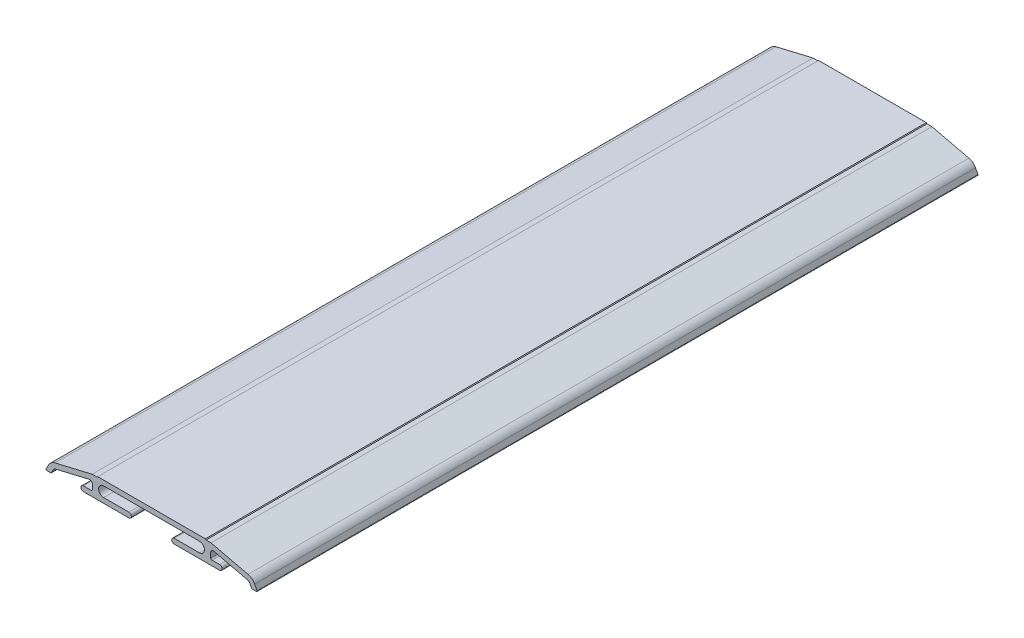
ISO-10303-21;
HEADER;
FILE_DESCRIPTION(('STEP AP214'),'2;1');
FILE_NAME('part.step','',(''),(''),'','','');
FILE_SCHEMA(('AUTOMOTIVE_DESIGN { 1 0 10303 214 1 1 1 1 }'));
ENDSEC;
DATA;
#1=APPLICATION_CONTEXT('core data for automotive mechanical design processes');
#2=APPLICATION_PROTOCOL_DEFINITION('international standard','automotive_design',2000,#1);
#3=PRODUCT_CONTEXT('',#1,'mechanical');
#4=PRODUCT('Part','Part','',(#3));
#5=PRODUCT_RELATED_PRODUCT_CATEGORY('part','',(#4));
#6=PRODUCT_DEFINITION_FORMATION('','',#4);
#7=PRODUCT_DEFINITION_CONTEXT('part definition',#1,'design');
#8=PRODUCT_DEFINITION('design','',#6,#7);
#9=PRODUCT_DEFINITION_SHAPE('','',#8);
#10=(LENGTH_UNIT() NAMED_UNIT(*) SI_UNIT(.MILLI.,.METRE.));
#11=(NAMED_UNIT(*) PLANE_ANGLE_UNIT() SI_UNIT($,.RADIAN.));
#12=(NAMED_UNIT(*) SI_UNIT($,.STERADIAN.) SOLID_ANGLE_UNIT());
#13=UNCERTAINTY_MEASURE_WITH_UNIT(LENGTH_MEASURE(1.E-05),#10,'distance_accuracy_value','');
#14=(GEOMETRIC_REPRESENTATION_CONTEXT(3) GLOBAL_UNCERTAINTY_ASSIGNED_CONTEXT((#13)) GLOBAL_UNIT_ASSIGNED_CONTEXT((#10,
#11,#12)) REPRESENTATION_CONTEXT('',''));
#15=CARTESIAN_POINT('',(0.,0.,0.));
#16=DIRECTION('',(0.,0.,1.));
#17=DIRECTION('',(1.,0.,0.));
#18=AXIS2_PLACEMENT_3D('',#15,#16,#17);
#19=CARTESIAN_POINT('',(41.0185728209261,54.1999999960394,-286.));
#20=DIRECTION('',(0.,0.,1.));
#21=DIRECTION('',(1.,0.,0.));
#22=AXIS2_PLACEMENT_3D('',#19,#20,#21);
#23=CYLINDRICAL_SURFACE('',#22,0.300000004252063);
#24=CARTESIAN_POINT('',(41.0185728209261,54.1999999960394,0.));
#25=DIRECTION('',(0.,0.,1.));
#26=DIRECTION('',(1.,0.,0.));
#27=AXIS2_PLACEMENT_3D('',#24,#25,#26);
#28=CIRCLE('',#27,0.300000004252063);
#29=CARTESIAN_POINT('',(41.0185728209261,53.8999999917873,0.));
#30=VERTEX_POINT('',#29);
#31=CARTESIAN_POINT('',(41.2840554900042,54.339710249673,0.));
#32=VERTEX_POINT('',#31);
#33=EDGE_CURVE('E342',#30,#32,#28,.T.);
#34=ORIENTED_EDGE('',*,*,#33,.F.);
#35=DIRECTION('',(0.,0.,1.));
#36=VECTOR('',#35,1.);
#37=CARTESIAN_POINT('',(41.0185728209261,53.8999999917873,-286.));
#38=LINE('',#37,#36);
#39=CARTESIAN_POINT('',(41.0185728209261,53.8999999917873,-286.));
#40=VERTEX_POINT('',#39);
#41=EDGE_CURVE('E11',#40,#30,#38,.T.);
#42=ORIENTED_EDGE('',*,*,#41,.F.);
#43=CARTESIAN_POINT('',(41.0185728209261,54.1999999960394,-286.));
#44=DIRECTION('',(0.,0.,1.));
#45=DIRECTION('',(1.,0.,0.));
#46=AXIS2_PLACEMENT_3D('',#43,#44,#45);
#47=CIRCLE('',#46,0.300000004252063);
#48=CARTESIAN_POINT('',(41.2840554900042,54.339710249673,-286.));
#49=VERTEX_POINT('',#48);
#50=EDGE_CURVE('E464',#40,#49,#47,.T.);
#51=ORIENTED_EDGE('',*,*,#50,.T.);
#52=DIRECTION('',(0.,0.,1.));
#53=VECTOR('',#52,1.);
#54=CARTESIAN_POINT('',(41.2840554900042,54.339710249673,-286.));
#55=LINE('',#54,#53);
#56=EDGE_CURVE('E44',#49,#32,#55,.T.);
#57=ORIENTED_EDGE('',*,*,#56,.T.);
#58=EDGE_LOOP('',(#34,#42,#51,#57));
#59=FACE_BOUND('',#58,.T.);
#60=ADVANCED_FACE('F41',(#59),#23,.T.);
#61=CARTESIAN_POINT('',(39.4365486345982,53.8999999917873,-286.));
#62=DIRECTION('',(0.,-1.,0.));
#63=DIRECTION('',(1.,0.,0.));
#64=AXIS2_PLACEMENT_3D('',#61,#62,#63);
#65=PLANE('',#64);
#66=DIRECTION('',(1.,0.,0.));
#67=VECTOR('',#66,1.);
#68=CARTESIAN_POINT('',(39.4365486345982,53.8999999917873,0.));
#69=LINE('',#68,#67);
#70=CARTESIAN_POINT('',(39.4365486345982,53.8999999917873,0.));
#71=VERTEX_POINT('',#70);
#72=EDGE_CURVE('E462',#71,#30,#69,.T.);
#73=ORIENTED_EDGE('',*,*,#72,.F.);
#74=DIRECTION('',(0.,0.,1.));
#75=VECTOR('',#74,1.);
#76=CARTESIAN_POINT('',(39.4365486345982,53.8999999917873,-286.));
#77=LINE('',#76,#75);
#78=CARTESIAN_POINT('',(39.4365486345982,53.8999999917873,-286.));
#79=VERTEX_POINT('',#78);
#80=EDGE_CURVE('E50',#79,#71,#77,.T.);
#81=ORIENTED_EDGE('',*,*,#80,.F.);
#82=DIRECTION('',(1.,0.,0.));
#83=VECTOR('',#82,1.);
#84=CARTESIAN_POINT('',(39.4365486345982,53.8999999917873,-286.));
#85=LINE('',#84,#83);
#86=EDGE_CURVE('E332',#79,#40,#85,.T.);
#87=ORIENTED_EDGE('',*,*,#86,.T.);
#88=ORIENTED_EDGE('',*,*,#41,.T.);
#89=EDGE_LOOP('',(#73,#81,#87,#88));
#90=FACE_BOUND('',#89,.T.);
#91=ADVANCED_FACE('F544',(#90),#65,.T.);
#92=CARTESIAN_POINT('',(39.4365486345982,54.1999999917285,-286.));
#93=DIRECTION('',(0.,0.,1.));
#94=DIRECTION('',(1.,0.,0.));
#95=AXIS2_PLACEMENT_3D('',#92,#93,#94);
#96=CYLINDRICAL_SURFACE('',#95,0.299999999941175);
#97=CARTESIAN_POINT('',(39.4365486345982,54.1999999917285,0.));
#98=DIRECTION('',(0.,0.,1.));
#99=DIRECTION('',(1.,0.,0.));
#100=AXIS2_PLACEMENT_3D('',#97,#98,#99);
#101=CIRCLE('',#100,0.299999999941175);
#102=CARTESIAN_POINT('',(39.1710659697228,54.0602897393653,0.));
#103=VERTEX_POINT('',#102);
#104=EDGE_CURVE('E319',#103,#71,#101,.T.);
#105=ORIENTED_EDGE('',*,*,#104,.F.);
#106=DIRECTION('',(0.,0.,1.));
#107=VECTOR('',#106,1.);
#108=CARTESIAN_POINT('',(39.1710659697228,54.0602897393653,-286.));
#109=LINE('',#108,#107);
#110=CARTESIAN_POINT('',(39.1710659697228,54.0602897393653,-286.));
#111=VERTEX_POINT('',#110);
#112=EDGE_CURVE('E314',#111,#103,#109,.T.);
#113=ORIENTED_EDGE('',*,*,#112,.F.);
#114=CARTESIAN_POINT('',(39.4365486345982,54.1999999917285,-286.));
#115=DIRECTION('',(0.,0.,1.));
#116=DIRECTION('',(1.,0.,0.));
#117=AXIS2_PLACEMENT_3D('',#114,#115,#116);
#118=CIRCLE('',#117,0.299999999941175);
#119=EDGE_CURVE('E317',#111,#79,#118,.T.);
#120=ORIENTED_EDGE('',*,*,#119,.T.);
#121=ORIENTED_EDGE('',*,*,#80,.T.);
#122=EDGE_LOOP('',(#105,#113,#120,#121));
#123=FACE_BOUND('',#122,.T.);
#124=ADVANCED_FACE('F316',(#123),#96,.T.);
#125=CARTESIAN_POINT('',(38.5727654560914,55.1972028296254,-286.));
#126=DIRECTION('',(-0.884942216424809,-0.465700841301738,0.));
#127=DIRECTION('',(0.465700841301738,-0.884942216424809,0.));
#128=AXIS2_PLACEMENT_3D('',#125,#126,#127);
#129=PLANE('',#128);
#130=DIRECTION('',(0.465700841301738,-0.884942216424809,0.));
#131=VECTOR('',#130,1.);
#132=CARTESIAN_POINT('',(38.5727654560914,55.1972028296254,0.));
#133=LINE('',#132,#131);
#134=CARTESIAN_POINT('',(38.5727654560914,55.1972028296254,0.));
#135=VERTEX_POINT('',#134);
#136=EDGE_CURVE('E459',#135,#103,#133,.T.);
#137=ORIENTED_EDGE('',*,*,#136,.F.);
#138=DIRECTION('',(0.,0.,1.));
#139=VECTOR('',#138,1.);
#140=CARTESIAN_POINT('',(38.5727654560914,55.1972028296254,-286.));
#141=LINE('',#140,#139);
#142=CARTESIAN_POINT('',(38.5727654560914,55.1972028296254,-286.));
#143=VERTEX_POINT('',#142);
#144=EDGE_CURVE('E324',#143,#135,#141,.T.);
#145=ORIENTED_EDGE('',*,*,#144,.F.);
#146=DIRECTION('',(0.465700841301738,-0.884942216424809,0.));
#147=VECTOR('',#146,1.);
#148=CARTESIAN_POINT('',(38.5727654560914,55.1972028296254,-286.));
#149=LINE('',#148,#147);
#150=EDGE_CURVE('E330',#143,#111,#149,.T.);
#151=ORIENTED_EDGE('',*,*,#150,.T.);
#152=ORIENTED_EDGE('',*,*,#112,.T.);
#153=EDGE_LOOP('',(#137,#145,#151,#152));
#154=FACE_BOUND('',#153,.T.);
#155=ADVANCED_FACE('F334',(#154),#129,.T.);
#156=CARTESIAN_POINT('',(36.8028810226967,54.2658011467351,-286.));
#157=DIRECTION('',(0.,0.,1.));
#158=DIRECTION('',(1.,0.,0.));
#159=AXIS2_PLACEMENT_3D('',#156,#157,#158);
#160=CYLINDRICAL_SURFACE('',#159,2.00000000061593);
#161=CARTESIAN_POINT('',(36.8028810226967,54.2658011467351,0.));
#162=DIRECTION('',(0.,0.,-1.));
#163=DIRECTION('',(-1.,0.,0.));
#164=AXIS2_PLACEMENT_3D('',#161,#162,#163);
#165=CIRCLE('',#164,2.00000000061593);
#166=CARTESIAN_POINT('',(37.2627042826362,56.2122241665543,0.));
#167=VERTEX_POINT('',#166);
#168=EDGE_CURVE('E456',#167,#135,#165,.T.);
#169=ORIENTED_EDGE('',*,*,#168,.F.);
#170=DIRECTION('',(0.,0.,1.));
#171=VECTOR('',#170,1.);
#172=CARTESIAN_POINT('',(37.2627042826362,56.2122241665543,-286.));
#173=LINE('',#172,#171);
#174=CARTESIAN_POINT('',(37.2627042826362,56.2122241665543,-286.));
#175=VERTEX_POINT('',#174);
#176=EDGE_CURVE('E468',#175,#167,#173,.T.);
#177=ORIENTED_EDGE('',*,*,#176,.F.);
#178=CARTESIAN_POINT('',(36.8028810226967,54.2658011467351,-286.));
#179=DIRECTION('',(0.,0.,-1.));
#180=DIRECTION('',(-1.,0.,0.));
#181=AXIS2_PLACEMENT_3D('',#178,#179,#180);
#182=CIRCLE('',#181,2.00000000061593);
#183=EDGE_CURVE('E335',#175,#143,#182,.T.);
#184=ORIENTED_EDGE('',*,*,#183,.T.);
#185=ORIENTED_EDGE('',*,*,#144,.T.);
#186=EDGE_LOOP('',(#169,#177,#184,#185));
#187=FACE_BOUND('',#186,.T.);
#188=ADVANCED_FACE('F557',(#187),#160,.F.);
#189=CARTESIAN_POINT('',(24.1453646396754,59.3110664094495,-286.));
#190=DIRECTION('',(-0.229911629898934,-0.973211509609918,0.));
#191=DIRECTION('',(0.973211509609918,-0.229911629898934,0.));
#192=AXIS2_PLACEMENT_3D('',#189,#190,#191);
#193=PLANE('',#192);
#194=DIRECTION('',(0.973211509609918,-0.229911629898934,0.));
#195=VECTOR('',#194,1.);
#196=CARTESIAN_POINT('',(24.1453646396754,59.3110664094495,0.));
#197=LINE('',#196,#195);
#198=CARTESIAN_POINT('',(24.1453646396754,59.3110664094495,0.));
#199=VERTEX_POINT('',#198);
#200=EDGE_CURVE('E453',#199,#167,#197,.T.);
#201=ORIENTED_EDGE('',*,*,#200,.F.);
#202=DIRECTION('',(0.,0.,1.));
#203=VECTOR('',#202,1.);
#204=CARTESIAN_POINT('',(24.1453646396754,59.3110664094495,-286.));
#205=LINE('',#204,#203);
#206=CARTESIAN_POINT('',(24.1453646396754,59.3110664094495,-286.));
#207=VERTEX_POINT('',#206);
#208=EDGE_CURVE('E470',#207,#199,#205,.T.);
#209=ORIENTED_EDGE('',*,*,#208,.F.);
#210=DIRECTION('',(0.973211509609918,-0.229911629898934,0.));
#211=VECTOR('',#210,1.);
#212=CARTESIAN_POINT('',(24.1453646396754,59.3110664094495,-286.));
#213=LINE('',#212,#211);
#214=EDGE_CURVE('E337',#207,#175,#213,.T.);
#215=ORIENTED_EDGE('',*,*,#214,.T.);
#216=ORIENTED_EDGE('',*,*,#176,.T.);
#217=EDGE_LOOP('',(#201,#209,#215,#216));
#218=FACE_BOUND('',#217,.T.);
#219=ADVANCED_FACE('F560',(#218),#193,.T.);
#220=CARTESIAN_POINT('',(23.9154530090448,58.3378548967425,-286.));
#221=DIRECTION('',(0.,0.,1.));
#222=DIRECTION('',(1.,0.,0.));
#223=AXIS2_PLACEMENT_3D('',#220,#221,#222);
#224=CYLINDRICAL_SURFACE('',#223,1.00000000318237);
#225=CARTESIAN_POINT('',(23.9154530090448,58.3378548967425,0.));
#226=DIRECTION('',(0.,0.,-1.));
#227=DIRECTION('',(-1.,0.,0.));
#228=AXIS2_PLACEMENT_3D('',#225,#226,#227);
#229=CIRCLE('',#228,1.00000000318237);
#230=CARTESIAN_POINT('',(22.9154530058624,58.3378548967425,0.));
#231=VERTEX_POINT('',#230);
#232=EDGE_CURVE('E450',#231,#199,#229,.T.);
#233=ORIENTED_EDGE('',*,*,#232,.F.);
#234=DIRECTION('',(0.,0.,1.));
#235=VECTOR('',#234,1.);
#236=CARTESIAN_POINT('',(22.9154530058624,58.3378548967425,-286.));
#237=LINE('',#236,#235);
#238=CARTESIAN_POINT('',(22.9154530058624,58.3378548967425,-286.));
#239=VERTEX_POINT('',#238);
#240=EDGE_CURVE('E472',#239,#231,#237,.T.);
#241=ORIENTED_EDGE('',*,*,#240,.F.);
#242=CARTESIAN_POINT('',(23.9154530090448,58.3378548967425,-286.));
#243=DIRECTION('',(0.,0.,-1.));
#244=DIRECTION('',(-1.,0.,0.));
#245=AXIS2_PLACEMENT_3D('',#242,#243,#244);
#246=CIRCLE('',#245,1.00000000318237);
#247=EDGE_CURVE('E1146',#239,#207,#246,.T.);
#248=ORIENTED_EDGE('',*,*,#247,.T.);
#249=ORIENTED_EDGE('',*,*,#208,.T.);
#250=EDGE_LOOP('',(#233,#241,#248,#249));
#251=FACE_BOUND('',#250,.T.);
#252=ADVANCED_FACE('F564',(#251),#224,.F.);
#253=CARTESIAN_POINT('',(22.9154530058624,56.3999999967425,-286.));
#254=DIRECTION('',(1.,0.,0.));
#255=DIRECTION('',(0.,1.,0.));
#256=AXIS2_PLACEMENT_3D('',#253,#254,#255);
#257=PLANE('',#256);
#258=DIRECTION('',(0.,1.,0.));
#259=VECTOR('',#258,1.);
#260=CARTESIAN_POINT('',(22.9154530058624,56.3999999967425,0.));
#261=LINE('',#260,#259);
#262=CARTESIAN_POINT('',(22.9154530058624,56.3999999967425,0.));
#263=VERTEX_POINT('',#262);
#264=EDGE_CURVE('E447',#263,#231,#261,.T.);
#265=ORIENTED_EDGE('',*,*,#264,.F.);
#266=DIRECTION('',(0.,0.,1.));
#267=VECTOR('',#266,1.);
#268=CARTESIAN_POINT('',(22.9154530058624,56.3999999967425,-286.));
#269=LINE('',#268,#267);
#270=CARTESIAN_POINT('',(22.9154530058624,56.3999999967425,-286.));
#271=VERTEX_POINT('',#270);
#272=EDGE_CURVE('E474',#271,#263,#269,.T.);
#273=ORIENTED_EDGE('',*,*,#272,.F.);
#274=DIRECTION('',(0.,1.,0.));
#275=VECTOR('',#274,1.);
#276=CARTESIAN_POINT('',(22.9154530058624,56.3999999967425,-286.));
#277=LINE('',#276,#275);
#278=EDGE_CURVE('E1150',#271,#239,#277,.T.);
#279=ORIENTED_EDGE('',*,*,#278,.T.);
#280=ORIENTED_EDGE('',*,*,#240,.T.);
#281=EDGE_LOOP('',(#265,#273,#279,#280));
#282=FACE_BOUND('',#281,.T.);
#283=ADVANCED_FACE('F568',(#282),#257,.T.);
#284=CARTESIAN_POINT('',(23.4154530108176,56.3999999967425,-286.));
#285=DIRECTION('',(0.,0.,1.));
#286=DIRECTION('',(1.,0.,0.));
#287=AXIS2_PLACEMENT_3D('',#284,#285,#286);
#288=CYLINDRICAL_SURFACE('',#287,0.500000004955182);
#289=CARTESIAN_POINT('',(23.4154530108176,56.3999999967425,0.));
#290=DIRECTION('',(0.,0.,-1.));
#291=DIRECTION('',(-1.,0.,0.));
#292=AXIS2_PLACEMENT_3D('',#289,#290,#291);
#293=CIRCLE('',#292,0.500000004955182);
#294=CARTESIAN_POINT('',(23.4154530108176,55.8999999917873,0.));
#295=VERTEX_POINT('',#294);
#296=EDGE_CURVE('E444',#295,#263,#293,.T.);
#297=ORIENTED_EDGE('',*,*,#296,.F.);
#298=DIRECTION('',(0.,0.,1.));
#299=VECTOR('',#298,1.);
#300=CARTESIAN_POINT('',(23.4154530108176,55.8999999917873,-286.));
#301=LINE('',#300,#299);
#302=CARTESIAN_POINT('',(23.4154530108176,55.8999999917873,-286.));
#303=VERTEX_POINT('',#302);
#304=EDGE_CURVE('E476',#303,#295,#301,.T.);
#305=ORIENTED_EDGE('',*,*,#304,.F.);
#306=CARTESIAN_POINT('',(23.4154530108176,56.3999999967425,-286.));
#307=DIRECTION('',(0.,0.,-1.));
#308=DIRECTION('',(-1.,0.,0.));
#309=AXIS2_PLACEMENT_3D('',#306,#307,#308);
#310=CIRCLE('',#309,0.500000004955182);
#311=EDGE_CURVE('E1139',#303,#271,#310,.T.);
#312=ORIENTED_EDGE('',*,*,#311,.T.);
#313=ORIENTED_EDGE('',*,*,#272,.T.);
#314=EDGE_LOOP('',(#297,#305,#312,#313));
#315=FACE_BOUND('',#314,.T.);
#316=ADVANCED_FACE('F572',(#315),#288,.F.);
#317=CARTESIAN_POINT('',(26.4454530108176,55.8999999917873,-286.));
#318=DIRECTION('',(0.,1.,0.));
#319=DIRECTION('',(0.,0.,1.));
#320=AXIS2_PLACEMENT_3D('',#317,#318,#319);
#321=PLANE('',#320);
#322=DIRECTION('',(-1.,0.,0.));
#323=VECTOR('',#322,1.);
#324=CARTESIAN_POINT('',(26.4454530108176,55.8999999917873,0.));
#325=LINE('',#324,#323);
#326=CARTESIAN_POINT('',(26.4454530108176,55.8999999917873,0.));
#327=VERTEX_POINT('',#326);
#328=EDGE_CURVE('E441',#327,#295,#325,.T.);
#329=ORIENTED_EDGE('',*,*,#328,.F.);
#330=DIRECTION('',(0.,0.,1.));
#331=VECTOR('',#330,1.);
#332=CARTESIAN_POINT('',(26.4454530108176,55.8999999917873,-286.));
#333=LINE('',#332,#331);
#334=CARTESIAN_POINT('',(26.4454530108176,55.8999999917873,-286.));
#335=VERTEX_POINT('',#334);
#336=EDGE_CURVE('E478',#335,#327,#333,.T.);
#337=ORIENTED_EDGE('',*,*,#336,.F.);
#338=DIRECTION('',(-1.,0.,0.));
#339=VECTOR('',#338,1.);
#340=CARTESIAN_POINT('',(26.4454530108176,55.8999999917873,-286.));
#341=LINE('',#340,#339);
#342=EDGE_CURVE('E1135',#335,#303,#341,.T.);
#343=ORIENTED_EDGE('',*,*,#342,.T.);
#344=ORIENTED_EDGE('',*,*,#304,.T.);
#345=EDGE_LOOP('',(#329,#337,#343,#344));
#346=FACE_BOUND('',#345,.T.);
#347=ADVANCED_FACE('F576',(#346),#321,.T.);
#348=CARTESIAN_POINT('',(26.4454530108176,54.8999999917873,-286.));
#349=DIRECTION('',(0.,0.,1.));
#350=DIRECTION('',(1.,0.,0.));
#351=AXIS2_PLACEMENT_3D('',#348,#349,#350);
#352=CYLINDRICAL_SURFACE('',#351,1.);
#353=CARTESIAN_POINT('',(26.4454530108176,54.8999999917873,0.));
#354=DIRECTION('',(0.,0.,1.));
#355=DIRECTION('',(1.,0.,0.));
#356=AXIS2_PLACEMENT_3D('',#353,#354,#355);
#357=CIRCLE('',#356,1.);
#358=CARTESIAN_POINT('',(26.4454530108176,53.8999999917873,0.));
#359=VERTEX_POINT('',#358);
#360=EDGE_CURVE('E438',#359,#327,#357,.T.);
#361=ORIENTED_EDGE('',*,*,#360,.F.);
#362=DIRECTION('',(0.,0.,1.));
#363=VECTOR('',#362,1.);
#364=CARTESIAN_POINT('',(26.4454530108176,53.8999999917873,-286.));
#365=LINE('',#364,#363);
#366=CARTESIAN_POINT('',(26.4454530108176,53.8999999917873,-286.));
#367=VERTEX_POINT('',#366);
#368=EDGE_CURVE('E480',#367,#359,#365,.T.);
#369=ORIENTED_EDGE('',*,*,#368,.F.);
#370=CARTESIAN_POINT('',(26.4454530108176,54.8999999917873,-286.));
#371=DIRECTION('',(0.,0.,1.));
#372=DIRECTION('',(1.,0.,0.));
#373=AXIS2_PLACEMENT_3D('',#370,#371,#372);
#374=CIRCLE('',#373,1.);
#375=EDGE_CURVE('E1156',#367,#335,#374,.T.);
#376=ORIENTED_EDGE('',*,*,#375,.T.);
#377=ORIENTED_EDGE('',*,*,#336,.T.);
#378=EDGE_LOOP('',(#361,#369,#376,#377));
#379=FACE_BOUND('',#378,.T.);
#380=ADVANCED_FACE('F580',(#379),#352,.T.);
#381=CARTESIAN_POINT('',(8.44545301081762,53.8999999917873,-286.));
#382=DIRECTION('',(0.,-1.,0.));
#383=DIRECTION('',(0.,0.,-1.));
#384=AXIS2_PLACEMENT_3D('',#381,#382,#383);
#385=PLANE('',#384);
#386=DIRECTION('',(1.,0.,0.));
#387=VECTOR('',#386,1.);
#388=CARTESIAN_POINT('',(8.44545301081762,53.8999999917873,0.));
#389=LINE('',#388,#387);
#390=CARTESIAN_POINT('',(8.44545301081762,53.8999999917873,0.));
#391=VERTEX_POINT('',#390);
#392=EDGE_CURVE('E435',#391,#359,#389,.T.);
#393=ORIENTED_EDGE('',*,*,#392,.F.);
#394=DIRECTION('',(0.,0.,1.));
#395=VECTOR('',#394,1.);
#396=CARTESIAN_POINT('',(8.44545301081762,53.8999999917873,-286.));
#397=LINE('',#396,#395);
#398=CARTESIAN_POINT('',(8.44545301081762,53.8999999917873,-286.));
#399=VERTEX_POINT('',#398);
#400=EDGE_CURVE('E482',#399,#391,#397,.T.);
#401=ORIENTED_EDGE('',*,*,#400,.F.);
#402=DIRECTION('',(1.,0.,0.));
#403=VECTOR('',#402,1.);
#404=CARTESIAN_POINT('',(8.44545301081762,53.8999999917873,-286.));
#405=LINE('',#404,#403);
#406=EDGE_CURVE('E1128',#399,#367,#405,.T.);
#407=ORIENTED_EDGE('',*,*,#406,.T.);
#408=ORIENTED_EDGE('',*,*,#368,.T.);
#409=EDGE_LOOP('',(#393,#401,#407,#408));
#410=FACE_BOUND('',#409,.T.);
#411=ADVANCED_FACE('F584',(#410),#385,.T.);
#412=CARTESIAN_POINT('',(8.44545301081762,54.8999999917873,-286.));
#413=DIRECTION('',(0.,0.,1.));
#414=DIRECTION('',(1.,0.,0.));
#415=AXIS2_PLACEMENT_3D('',#412,#413,#414);
#416=CYLINDRICAL_SURFACE('',#415,1.);
#417=CARTESIAN_POINT('',(8.44545301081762,54.8999999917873,0.));
#418=DIRECTION('',(0.,0.,1.));
#419=DIRECTION('',(1.,0.,0.));
#420=AXIS2_PLACEMENT_3D('',#417,#418,#419);
#421=CIRCLE('',#420,1.);
#422=CARTESIAN_POINT('',(8.44545301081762,55.8999999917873,0.));
#423=VERTEX_POINT('',#422);
#424=EDGE_CURVE('E432',#423,#391,#421,.T.);
#425=ORIENTED_EDGE('',*,*,#424,.F.);
#426=DIRECTION('',(0.,0.,1.));
#427=VECTOR('',#426,1.);
#428=CARTESIAN_POINT('',(8.44545301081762,55.8999999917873,-286.));
#429=LINE('',#428,#427);
#430=CARTESIAN_POINT('',(8.44545301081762,55.8999999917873,-286.));
#431=VERTEX_POINT('',#430);
#432=EDGE_CURVE('E484',#431,#423,#429,.T.);
#433=ORIENTED_EDGE('',*,*,#432,.F.);
#434=CARTESIAN_POINT('',(8.44545301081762,54.8999999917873,-286.));
#435=DIRECTION('',(0.,0.,1.));
#436=DIRECTION('',(1.,0.,0.));
#437=AXIS2_PLACEMENT_3D('',#434,#435,#436);
#438=CIRCLE('',#437,1.);
#439=EDGE_CURVE('E1124',#431,#399,#438,.T.);
#440=ORIENTED_EDGE('',*,*,#439,.T.);
#441=ORIENTED_EDGE('',*,*,#400,.T.);
#442=EDGE_LOOP('',(#425,#433,#440,#441));
#443=FACE_BOUND('',#442,.T.);
#444=ADVANCED_FACE('F588',(#443),#416,.T.);
#445=CARTESIAN_POINT('',(18.4454530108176,55.8999999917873,-286.));
#446=DIRECTION('',(0.,1.,0.));
#447=DIRECTION('',(-1.,0.,0.));
#448=AXIS2_PLACEMENT_3D('',#445,#446,#447);
#449=PLANE('',#448);
#450=DIRECTION('',(-1.,0.,0.));
#451=VECTOR('',#450,1.);
#452=CARTESIAN_POINT('',(18.4454530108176,55.8999999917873,0.));
#453=LINE('',#452,#451);
#454=CARTESIAN_POINT('',(18.4454530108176,55.8999999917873,0.));
#455=VERTEX_POINT('',#454);
#456=EDGE_CURVE('E429',#455,#423,#453,.T.);
#457=ORIENTED_EDGE('',*,*,#456,.F.);
#458=DIRECTION('',(0.,0.,1.));
#459=VECTOR('',#458,1.);
#460=CARTESIAN_POINT('',(18.4454530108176,55.8999999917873,-286.));
#461=LINE('',#460,#459);
#462=CARTESIAN_POINT('',(18.4454530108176,55.8999999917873,-286.));
#463=VERTEX_POINT('',#462);
#464=EDGE_CURVE('E486',#463,#455,#461,.T.);
#465=ORIENTED_EDGE('',*,*,#464,.F.);
#466=DIRECTION('',(-1.,0.,0.));
#467=VECTOR('',#466,1.);
#468=CARTESIAN_POINT('',(18.4454530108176,55.8999999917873,-286.));
#469=LINE('',#468,#467);
#470=EDGE_CURVE('E1160',#463,#431,#469,.T.);
#471=ORIENTED_EDGE('',*,*,#470,.T.);
#472=ORIENTED_EDGE('',*,*,#432,.T.);
#473=EDGE_LOOP('',(#457,#465,#471,#472));
#474=FACE_BOUND('',#473,.T.);
#475=ADVANCED_FACE('F592',(#474),#449,.T.);
#476=CARTESIAN_POINT('',(18.4454530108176,57.8999999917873,-286.));
#477=DIRECTION('',(0.,0.,1.));
#478=DIRECTION('',(1.,0.,0.));
#479=AXIS2_PLACEMENT_3D('',#476,#477,#478);
#480=CYLINDRICAL_SURFACE('',#479,2.);
#481=CARTESIAN_POINT('',(18.4454530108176,57.8999999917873,0.));
#482=DIRECTION('',(0.,0.,-1.));
#483=DIRECTION('',(-1.,0.,0.));
#484=AXIS2_PLACEMENT_3D('',#481,#482,#483);
#485=CIRCLE('',#484,2.);
#486=CARTESIAN_POINT('',(18.4454530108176,59.8999999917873,0.));
#487=VERTEX_POINT('',#486);
#488=EDGE_CURVE('E426',#487,#455,#485,.T.);
#489=ORIENTED_EDGE('',*,*,#488,.F.);
#490=DIRECTION('',(0.,0.,1.));
#491=VECTOR('',#490,1.);
#492=CARTESIAN_POINT('',(18.4454530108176,59.8999999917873,-286.));
#493=LINE('',#492,#491);
#494=CARTESIAN_POINT('',(18.4454530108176,59.8999999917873,-286.));
#495=VERTEX_POINT('',#494);
#496=EDGE_CURVE('E488',#495,#487,#493,.T.);
#497=ORIENTED_EDGE('',*,*,#496,.F.);
#498=CARTESIAN_POINT('',(18.4454530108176,57.8999999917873,-286.));
#499=DIRECTION('',(0.,0.,-1.));
#500=DIRECTION('',(-1.,0.,0.));
#501=AXIS2_PLACEMENT_3D('',#498,#499,#500);
#502=CIRCLE('',#501,2.);
#503=EDGE_CURVE('E1117',#495,#463,#502,.T.);
#504=ORIENTED_EDGE('',*,*,#503,.T.);
#505=ORIENTED_EDGE('',*,*,#464,.T.);
#506=EDGE_LOOP('',(#489,#497,#504,#505));
#507=FACE_BOUND('',#506,.T.);
#508=ADVANCED_FACE('F596',(#507),#480,.F.);
#509=CARTESIAN_POINT('',(-19.5545469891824,59.8999999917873,-286.));
#510=DIRECTION('',(0.,-1.,0.));
#511=DIRECTION('',(0.,0.,-1.));
#512=AXIS2_PLACEMENT_3D('',#509,#510,#511);
#513=PLANE('',#512);
#514=DIRECTION('',(1.,0.,0.));
#515=VECTOR('',#514,1.);
#516=CARTESIAN_POINT('',(-19.5545469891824,59.8999999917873,0.));
#517=LINE('',#516,#515);
#518=CARTESIAN_POINT('',(-19.5545469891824,59.8999999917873,0.));
#519=VERTEX_POINT('',#518);
#520=EDGE_CURVE('E423',#519,#487,#517,.T.);
#521=ORIENTED_EDGE('',*,*,#520,.F.);
#522=DIRECTION('',(0.,0.,1.));
#523=VECTOR('',#522,1.);
#524=CARTESIAN_POINT('',(-19.5545469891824,59.8999999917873,-286.));
#525=LINE('',#524,#523);
#526=CARTESIAN_POINT('',(-19.5545469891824,59.8999999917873,-286.));
#527=VERTEX_POINT('',#526);
#528=EDGE_CURVE('E490',#527,#519,#525,.T.);
#529=ORIENTED_EDGE('',*,*,#528,.F.);
#530=DIRECTION('',(1.,0.,0.));
#531=VECTOR('',#530,1.);
#532=CARTESIAN_POINT('',(-19.5545469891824,59.8999999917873,-286.));
#533=LINE('',#532,#531);
#534=EDGE_CURVE('E1113',#527,#495,#533,.T.);
#535=ORIENTED_EDGE('',*,*,#534,.T.);
#536=ORIENTED_EDGE('',*,*,#496,.T.);
#537=EDGE_LOOP('',(#521,#529,#535,#536));
#538=FACE_BOUND('',#537,.T.);
#539=ADVANCED_FACE('F600',(#538),#513,.T.);
#540=CARTESIAN_POINT('',(-19.5545469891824,57.8999999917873,-286.));
#541=DIRECTION('',(0.,0.,1.));
#542=DIRECTION('',(1.,0.,0.));
#543=AXIS2_PLACEMENT_3D('',#540,#541,#542);
#544=CYLINDRICAL_SURFACE('',#543,2.);
#545=CARTESIAN_POINT('',(-19.5545469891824,57.8999999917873,0.));
#546=DIRECTION('',(0.,0.,-1.));
#547=DIRECTION('',(-1.,0.,0.));
#548=AXIS2_PLACEMENT_3D('',#545,#546,#547);
#549=CIRCLE('',#548,2.);
#550=CARTESIAN_POINT('',(-19.5545469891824,55.8999999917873,0.));
#551=VERTEX_POINT('',#550);
#552=EDGE_CURVE('E420',#551,#519,#549,.T.);
#553=ORIENTED_EDGE('',*,*,#552,.F.);
#554=DIRECTION('',(0.,0.,1.));
#555=VECTOR('',#554,1.);
#556=CARTESIAN_POINT('',(-19.5545469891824,55.8999999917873,-286.));
#557=LINE('',#556,#555);
#558=CARTESIAN_POINT('',(-19.5545469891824,55.8999999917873,-286.));
#559=VERTEX_POINT('',#558);
#560=EDGE_CURVE('E492',#559,#551,#557,.T.);
#561=ORIENTED_EDGE('',*,*,#560,.F.);
#562=CARTESIAN_POINT('',(-19.5545469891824,57.8999999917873,-286.));
#563=DIRECTION('',(0.,0.,-1.));
#564=DIRECTION('',(-1.,0.,0.));
#565=AXIS2_PLACEMENT_3D('',#562,#563,#564);
#566=CIRCLE('',#565,2.);
#567=EDGE_CURVE('E1164',#559,#527,#566,.T.);
#568=ORIENTED_EDGE('',*,*,#567,.T.);
#569=ORIENTED_EDGE('',*,*,#528,.T.);
#570=EDGE_LOOP('',(#553,#561,#568,#569));
#571=FACE_BOUND('',#570,.T.);
#572=ADVANCED_FACE('F604',(#571),#544,.F.);
#573=CARTESIAN_POINT('',(-9.55454698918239,55.8999999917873,-286.));
#574=DIRECTION('',(0.,1.,0.));
#575=DIRECTION('',(0.,0.,1.));
#576=AXIS2_PLACEMENT_3D('',#573,#574,#575);
#577=PLANE('',#576);
#578=DIRECTION('',(-1.,0.,0.));
#579=VECTOR('',#578,1.);
#580=CARTESIAN_POINT('',(-9.55454698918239,55.8999999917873,0.));
#581=LINE('',#580,#579);
#582=CARTESIAN_POINT('',(-9.55454698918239,55.8999999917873,0.));
#583=VERTEX_POINT('',#582);
#584=EDGE_CURVE('E417',#583,#551,#581,.T.);
#585=ORIENTED_EDGE('',*,*,#584,.F.);
#586=DIRECTION('',(0.,0.,1.));
#587=VECTOR('',#586,1.);
#588=CARTESIAN_POINT('',(-9.55454698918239,55.8999999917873,-286.));
#589=LINE('',#588,#587);
#590=CARTESIAN_POINT('',(-9.55454698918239,55.8999999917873,-286.));
#591=VERTEX_POINT('',#590);
#592=EDGE_CURVE('E494',#591,#583,#589,.T.);
#593=ORIENTED_EDGE('',*,*,#592,.F.);
#594=DIRECTION('',(-1.,0.,0.));
#595=VECTOR('',#594,1.);
#596=CARTESIAN_POINT('',(-9.55454698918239,55.8999999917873,-286.));
#597=LINE('',#596,#595);
#598=EDGE_CURVE('E1106',#591,#559,#597,.T.);
#599=ORIENTED_EDGE('',*,*,#598,.T.);
#600=ORIENTED_EDGE('',*,*,#560,.T.);
#601=EDGE_LOOP('',(#585,#593,#599,#600));
#602=FACE_BOUND('',#601,.T.);
#603=ADVANCED_FACE('F608',(#602),#577,.T.);
#604=CARTESIAN_POINT('',(-9.55454698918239,54.8999999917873,-286.));
#605=DIRECTION('',(0.,0.,1.));
#606=DIRECTION('',(1.,0.,0.));
#607=AXIS2_PLACEMENT_3D('',#604,#605,#606);
#608=CYLINDRICAL_SURFACE('',#607,1.);
#609=CARTESIAN_POINT('',(-9.55454698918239,54.8999999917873,0.));
#610=DIRECTION('',(0.,0.,1.));
#611=DIRECTION('',(1.,0.,0.));
#612=AXIS2_PLACEMENT_3D('',#609,#610,#611);
#613=CIRCLE('',#612,1.);
#614=CARTESIAN_POINT('',(-9.55454698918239,53.8999999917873,0.));
#615=VERTEX_POINT('',#614);
#616=EDGE_CURVE('E414',#615,#583,#613,.T.);
#617=ORIENTED_EDGE('',*,*,#616,.F.);
#618=DIRECTION('',(0.,0.,1.));
#619=VECTOR('',#618,1.);
#620=CARTESIAN_POINT('',(-9.55454698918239,53.8999999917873,-286.));
#621=LINE('',#620,#619);
#622=CARTESIAN_POINT('',(-9.55454698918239,53.8999999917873,-286.));
#623=VERTEX_POINT('',#622);
#624=EDGE_CURVE('E496',#623,#615,#621,.T.);
#625=ORIENTED_EDGE('',*,*,#624,.F.);
#626=CARTESIAN_POINT('',(-9.55454698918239,54.8999999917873,-286.));
#627=DIRECTION('',(0.,0.,1.));
#628=DIRECTION('',(1.,0.,0.));
#629=AXIS2_PLACEMENT_3D('',#626,#627,#628);
#630=CIRCLE('',#629,1.);
#631=EDGE_CURVE('E1102',#623,#591,#630,.T.);
#632=ORIENTED_EDGE('',*,*,#631,.T.);
#633=ORIENTED_EDGE('',*,*,#592,.T.);
#634=EDGE_LOOP('',(#617,#625,#632,#633));
#635=FACE_BOUND('',#634,.T.);
#636=ADVANCED_FACE('F612',(#635),#608,.T.);
#637=CARTESIAN_POINT('',(-27.5545469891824,53.8999999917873,-286.));
#638=DIRECTION('',(0.,-1.,0.));
#639=DIRECTION('',(1.,0.,0.));
#640=AXIS2_PLACEMENT_3D('',#637,#638,#639);
#641=PLANE('',#640);
#642=DIRECTION('',(1.,0.,0.));
#643=VECTOR('',#642,1.);
#644=CARTESIAN_POINT('',(-27.5545469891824,53.8999999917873,0.));
#645=LINE('',#644,#643);
#646=CARTESIAN_POINT('',(-27.5545469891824,53.8999999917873,0.));
#647=VERTEX_POINT('',#646);
#648=EDGE_CURVE('E411',#647,#615,#645,.T.);
#649=ORIENTED_EDGE('',*,*,#648,.F.);
#650=DIRECTION('',(0.,0.,1.));
#651=VECTOR('',#650,1.);
#652=CARTESIAN_POINT('',(-27.5545469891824,53.8999999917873,-286.));
#653=LINE('',#652,#651);
#654=CARTESIAN_POINT('',(-27.5545469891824,53.8999999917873,-286.));
#655=VERTEX_POINT('',#654);
#656=EDGE_CURVE('E498',#655,#647,#653,.T.);
#657=ORIENTED_EDGE('',*,*,#656,.F.);
#658=DIRECTION('',(1.,0.,0.));
#659=VECTOR('',#658,1.);
#660=CARTESIAN_POINT('',(-27.5545469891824,53.8999999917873,-286.));
#661=LINE('',#660,#659);
#662=EDGE_CURVE('E1168',#655,#623,#661,.T.);
#663=ORIENTED_EDGE('',*,*,#662,.T.);
#664=ORIENTED_EDGE('',*,*,#624,.T.);
#665=EDGE_LOOP('',(#649,#657,#663,#664));
#666=FACE_BOUND('',#665,.T.);
#667=ADVANCED_FACE('F616',(#666),#641,.T.);
#668=CARTESIAN_POINT('',(-27.5545469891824,54.8999999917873,-286.));
#669=DIRECTION('',(0.,0.,1.));
#670=DIRECTION('',(1.,0.,0.));
#671=AXIS2_PLACEMENT_3D('',#668,#669,#670);
#672=CYLINDRICAL_SURFACE('',#671,0.999999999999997);
#673=CARTESIAN_POINT('',(-27.5545469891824,54.8999999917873,0.));
#674=DIRECTION('',(0.,0.,1.));
#675=DIRECTION('',(1.,0.,0.));
#676=AXIS2_PLACEMENT_3D('',#673,#674,#675);
#677=CIRCLE('',#676,0.999999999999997);
#678=CARTESIAN_POINT('',(-27.5545469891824,55.8999999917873,0.));
#679=VERTEX_POINT('',#678);
#680=EDGE_CURVE('E408',#679,#647,#677,.T.);
#681=ORIENTED_EDGE('',*,*,#680,.F.);
#682=DIRECTION('',(0.,0.,1.));
#683=VECTOR('',#682,1.);
#684=CARTESIAN_POINT('',(-27.5545469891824,55.8999999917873,-286.));
#685=LINE('',#684,#683);
#686=CARTESIAN_POINT('',(-27.5545469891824,55.8999999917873,-286.));
#687=VERTEX_POINT('',#686);
#688=EDGE_CURVE('E500',#687,#679,#685,.T.);
#689=ORIENTED_EDGE('',*,*,#688,.F.);
#690=CARTESIAN_POINT('',(-27.5545469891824,54.8999999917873,-286.));
#691=DIRECTION('',(0.,0.,1.));
#692=DIRECTION('',(1.,0.,0.));
#693=AXIS2_PLACEMENT_3D('',#690,#691,#692);
#694=CIRCLE('',#693,0.999999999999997);
#695=EDGE_CURVE('E1095',#687,#655,#694,.T.);
#696=ORIENTED_EDGE('',*,*,#695,.T.);
#697=ORIENTED_EDGE('',*,*,#656,.T.);
#698=EDGE_LOOP('',(#681,#689,#696,#697));
#699=FACE_BOUND('',#698,.T.);
#700=ADVANCED_FACE('F620',(#699),#672,.T.);
#701=CARTESIAN_POINT('',(-24.5245469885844,55.8999999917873,-286.));
#702=DIRECTION('',(0.,1.,0.));
#703=DIRECTION('',(-1.,0.,0.));
#704=AXIS2_PLACEMENT_3D('',#701,#702,#703);
#705=PLANE('',#704);
#706=DIRECTION('',(-1.,0.,0.));
#707=VECTOR('',#706,1.);
#708=CARTESIAN_POINT('',(-24.5245469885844,55.8999999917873,0.));
#709=LINE('',#708,#707);
#710=CARTESIAN_POINT('',(-24.5245469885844,55.8999999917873,0.));
#711=VERTEX_POINT('',#710);
#712=EDGE_CURVE('E405',#711,#679,#709,.T.);
#713=ORIENTED_EDGE('',*,*,#712,.F.);
#714=DIRECTION('',(0.,0.,1.));
#715=VECTOR('',#714,1.);
#716=CARTESIAN_POINT('',(-24.5245469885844,55.8999999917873,-286.));
#717=LINE('',#716,#715);
#718=CARTESIAN_POINT('',(-24.5245469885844,55.8999999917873,-286.));
#719=VERTEX_POINT('',#718);
#720=EDGE_CURVE('E502',#719,#711,#717,.T.);
#721=ORIENTED_EDGE('',*,*,#720,.F.);
#722=DIRECTION('',(-1.,0.,0.));
#723=VECTOR('',#722,1.);
#724=CARTESIAN_POINT('',(-24.5245469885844,55.8999999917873,-286.));
#725=LINE('',#724,#723);
#726=EDGE_CURVE('E1091',#719,#687,#725,.T.);
#727=ORIENTED_EDGE('',*,*,#726,.T.);
#728=ORIENTED_EDGE('',*,*,#688,.T.);
#729=EDGE_LOOP('',(#713,#721,#727,#728));
#730=FACE_BOUND('',#729,.T.);
#731=ADVANCED_FACE('F624',(#730),#705,.T.);
#732=CARTESIAN_POINT('',(-24.5245469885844,56.3999999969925,-286.));
#733=DIRECTION('',(0.,0.,1.));
#734=DIRECTION('',(1.,0.,0.));
#735=AXIS2_PLACEMENT_3D('',#732,#733,#734);
#736=CYLINDRICAL_SURFACE('',#735,0.500000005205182);
#737=CARTESIAN_POINT('',(-24.5245469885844,56.3999999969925,0.));
#738=DIRECTION('',(0.,0.,-1.));
#739=DIRECTION('',(-1.,0.,0.));
#740=AXIS2_PLACEMENT_3D('',#737,#738,#739);
#741=CIRCLE('',#740,0.500000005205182);
#742=CARTESIAN_POINT('',(-24.0245469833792,56.3999999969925,0.));
#743=VERTEX_POINT('',#742);
#744=EDGE_CURVE('E402',#743,#711,#741,.T.);
#745=ORIENTED_EDGE('',*,*,#744,.F.);
#746=DIRECTION('',(0.,0.,1.));
#747=VECTOR('',#746,1.);
#748=CARTESIAN_POINT('',(-24.0245469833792,56.3999999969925,-286.));
#749=LINE('',#748,#747);
#750=CARTESIAN_POINT('',(-24.0245469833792,56.3999999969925,-286.));
#751=VERTEX_POINT('',#750);
#752=EDGE_CURVE('E504',#751,#743,#749,.T.);
#753=ORIENTED_EDGE('',*,*,#752,.F.);
#754=CARTESIAN_POINT('',(-24.5245469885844,56.3999999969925,-286.));
#755=DIRECTION('',(0.,0.,-1.));
#756=DIRECTION('',(-1.,0.,0.));
#757=AXIS2_PLACEMENT_3D('',#754,#755,#756);
#758=CIRCLE('',#757,0.500000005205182);
#759=EDGE_CURVE('E1172',#751,#719,#758,.T.);
#760=ORIENTED_EDGE('',*,*,#759,.T.);
#761=ORIENTED_EDGE('',*,*,#720,.T.);
#762=EDGE_LOOP('',(#745,#753,#760,#761));
#763=FACE_BOUND('',#762,.T.);
#764=ADVANCED_FACE('F628',(#763),#736,.F.);
#765=CARTESIAN_POINT('',(-24.0245469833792,58.3378548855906,-286.));
#766=DIRECTION('',(-1.,0.,0.));
#767=DIRECTION('',(0.,0.,1.));
#768=AXIS2_PLACEMENT_3D('',#765,#766,#767);
#769=PLANE('',#768);
#770=DIRECTION('',(0.,-1.,0.));
#771=VECTOR('',#770,1.);
#772=CARTESIAN_POINT('',(-24.0245469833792,58.3378548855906,0.));
#773=LINE('',#772,#771);
#774=CARTESIAN_POINT('',(-24.0245469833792,58.3378548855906,0.));
#775=VERTEX_POINT('',#774);
#776=EDGE_CURVE('E399',#775,#743,#773,.T.);
#777=ORIENTED_EDGE('',*,*,#776,.F.);
#778=DIRECTION('',(0.,0.,1.));
#779=VECTOR('',#778,1.);
#780=CARTESIAN_POINT('',(-24.0245469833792,58.3378548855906,-286.));
#781=LINE('',#780,#779);
#782=CARTESIAN_POINT('',(-24.0245469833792,58.3378548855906,-286.));
#783=VERTEX_POINT('',#782);
#784=EDGE_CURVE('E506',#783,#775,#781,.T.);
#785=ORIENTED_EDGE('',*,*,#784,.F.);
#786=DIRECTION('',(0.,-1.,0.));
#787=VECTOR('',#786,1.);
#788=CARTESIAN_POINT('',(-24.0245469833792,58.3378548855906,-286.));
#789=LINE('',#788,#787);
#790=EDGE_CURVE('E1084',#783,#751,#789,.T.);
#791=ORIENTED_EDGE('',*,*,#790,.T.);
#792=ORIENTED_EDGE('',*,*,#752,.T.);
#793=EDGE_LOOP('',(#777,#785,#791,#792));
#794=FACE_BOUND('',#793,.T.);
#795=ADVANCED_FACE('F632',(#794),#769,.T.);
#796=CARTESIAN_POINT('',(-25.0245469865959,58.3378548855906,-286.));
#797=DIRECTION('',(0.,0.,1.));
#798=DIRECTION('',(1.,0.,0.));
#799=AXIS2_PLACEMENT_3D('',#796,#797,#798);
#800=CYLINDRICAL_SURFACE('',#799,1.00000000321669);
#801=CARTESIAN_POINT('',(-25.0245469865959,58.3378548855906,0.));
#802=DIRECTION('',(0.,0.,-1.));
#803=DIRECTION('',(-1.,0.,0.));
#804=AXIS2_PLACEMENT_3D('',#801,#802,#803);
#805=CIRCLE('',#804,1.00000000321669);
#806=CARTESIAN_POINT('',(-25.2544586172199,59.3110663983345,0.));
#807=VERTEX_POINT('',#806);
#808=EDGE_CURVE('E396',#807,#775,#805,.T.);
#809=ORIENTED_EDGE('',*,*,#808,.F.);
#810=DIRECTION('',(0.,0.,1.));
#811=VECTOR('',#810,1.);
#812=CARTESIAN_POINT('',(-25.2544586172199,59.3110663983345,-286.));
#813=LINE('',#812,#811);
#814=CARTESIAN_POINT('',(-25.2544586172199,59.3110663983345,-286.));
#815=VERTEX_POINT('',#814);
#816=EDGE_CURVE('E508',#815,#807,#813,.T.);
#817=ORIENTED_EDGE('',*,*,#816,.F.);
#818=CARTESIAN_POINT('',(-25.0245469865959,58.3378548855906,-286.));
#819=DIRECTION('',(0.,0.,-1.));
#820=DIRECTION('',(-1.,0.,0.));
#821=AXIS2_PLACEMENT_3D('',#818,#819,#820);
#822=CIRCLE('',#821,1.00000000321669);
#823=EDGE_CURVE('E1080',#815,#783,#822,.T.);
#824=ORIENTED_EDGE('',*,*,#823,.T.);
#825=ORIENTED_EDGE('',*,*,#784,.T.);
#826=EDGE_LOOP('',(#809,#817,#824,#825));
#827=FACE_BOUND('',#826,.T.);
#828=ADVANCED_FACE('F636',(#827),#800,.F.);
#829=CARTESIAN_POINT('',(-38.3717982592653,56.2122241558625,-286.));
#830=DIRECTION('',(0.229911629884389,-0.973211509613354,0.));
#831=DIRECTION('',(0.973211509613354,0.229911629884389,0.));
#832=AXIS2_PLACEMENT_3D('',#829,#830,#831);
#833=PLANE('',#832);
#834=DIRECTION('',(0.973211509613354,0.229911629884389,0.));
#835=VECTOR('',#834,1.);
#836=CARTESIAN_POINT('',(-38.3717982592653,56.2122241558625,0.));
#837=LINE('',#836,#835);
#838=CARTESIAN_POINT('',(-38.3717982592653,56.2122241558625,0.));
#839=VERTEX_POINT('',#838);
#840=EDGE_CURVE('E393',#839,#807,#837,.T.);
#841=ORIENTED_EDGE('',*,*,#840,.F.);
#842=DIRECTION('',(0.,0.,1.));
#843=VECTOR('',#842,1.);
#844=CARTESIAN_POINT('',(-38.3717982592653,56.2122241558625,-286.));
#845=LINE('',#844,#843);
#846=CARTESIAN_POINT('',(-38.3717982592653,56.2122241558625,-286.));
#847=VERTEX_POINT('',#846);
#848=EDGE_CURVE('E510',#847,#839,#845,.T.);
#849=ORIENTED_EDGE('',*,*,#848,.F.);
#850=DIRECTION('',(0.973211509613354,0.229911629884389,0.));
#851=VECTOR('',#850,1.);
#852=CARTESIAN_POINT('',(-38.3717982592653,56.2122241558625,-286.));
#853=LINE('',#852,#851);
#854=EDGE_CURVE('E1176',#847,#815,#853,.T.);
#855=ORIENTED_EDGE('',*,*,#854,.T.);
#856=ORIENTED_EDGE('',*,*,#816,.T.);
#857=EDGE_LOOP('',(#841,#849,#855,#856));
#858=FACE_BOUND('',#857,.T.);
#859=ADVANCED_FACE('F640',(#858),#833,.T.);
#860=CARTESIAN_POINT('',(-37.9119750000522,54.2658011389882,-286.));
#861=DIRECTION('',(0.,0.,1.));
#862=DIRECTION('',(1.,0.,0.));
#863=AXIS2_PLACEMENT_3D('',#860,#861,#862);
#864=CYLINDRICAL_SURFACE('',#863,1.99999999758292);
#865=CARTESIAN_POINT('',(-37.9119750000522,54.2658011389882,0.));
#866=DIRECTION('',(0.,0.,-1.));
#867=DIRECTION('',(-1.,0.,0.));
#868=AXIS2_PLACEMENT_3D('',#865,#866,#867);
#869=CIRCLE('',#868,1.99999999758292);
#870=CARTESIAN_POINT('',(-39.6818594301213,55.1972028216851,0.));
#871=VERTEX_POINT('',#870);
#872=EDGE_CURVE('E390',#871,#839,#869,.T.);
#873=ORIENTED_EDGE('',*,*,#872,.F.);
#874=DIRECTION('',(0.,0.,1.));
#875=VECTOR('',#874,1.);
#876=CARTESIAN_POINT('',(-39.6818594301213,55.1972028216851,-286.));
#877=LINE('',#876,#875);
#878=CARTESIAN_POINT('',(-39.6818594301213,55.1972028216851,-286.));
#879=VERTEX_POINT('',#878);
#880=EDGE_CURVE('E512',#879,#871,#877,.T.);
#881=ORIENTED_EDGE('',*,*,#880,.F.);
#882=CARTESIAN_POINT('',(-37.9119750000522,54.2658011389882,-286.));
#883=DIRECTION('',(0.,0.,-1.));
#884=DIRECTION('',(-1.,0.,0.));
#885=AXIS2_PLACEMENT_3D('',#882,#883,#884);
#886=CIRCLE('',#885,1.99999999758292);
#887=EDGE_CURVE('E1073',#879,#847,#886,.T.);
#888=ORIENTED_EDGE('',*,*,#887,.T.);
#889=ORIENTED_EDGE('',*,*,#848,.T.);
#890=EDGE_LOOP('',(#873,#881,#888,#889));
#891=FACE_BOUND('',#890,.T.);
#892=ADVANCED_FACE('F644',(#891),#864,.F.);
#893=CARTESIAN_POINT('',(-40.2801599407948,54.0602897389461,-286.));
#894=DIRECTION('',(0.884942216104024,-0.465700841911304,0.));
#895=DIRECTION('',(0.465700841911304,0.884942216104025,0.));
#896=AXIS2_PLACEMENT_3D('',#893,#894,#895);
#897=PLANE('',#896);
#898=DIRECTION('',(0.465700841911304,0.884942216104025,0.));
#899=VECTOR('',#898,1.);
#900=CARTESIAN_POINT('',(-40.2801599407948,54.0602897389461,0.));
#901=LINE('',#900,#899);
#902=CARTESIAN_POINT('',(-40.2801599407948,54.0602897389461,0.));
#903=VERTEX_POINT('',#902);
#904=EDGE_CURVE('E387',#903,#871,#901,.T.);
#905=ORIENTED_EDGE('',*,*,#904,.F.);
#906=DIRECTION('',(0.,0.,1.));
#907=VECTOR('',#906,1.);
#908=CARTESIAN_POINT('',(-40.2801599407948,54.0602897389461,-286.));
#909=LINE('',#908,#907);
#910=CARTESIAN_POINT('',(-40.2801599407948,54.0602897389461,-286.));
#911=VERTEX_POINT('',#910);
#912=EDGE_CURVE('E514',#911,#903,#909,.T.);
#913=ORIENTED_EDGE('',*,*,#912,.F.);
#914=DIRECTION('',(0.465700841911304,0.884942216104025,0.));
#915=VECTOR('',#914,1.);
#916=CARTESIAN_POINT('',(-40.2801599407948,54.0602897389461,-286.));
#917=LINE('',#916,#915);
#918=EDGE_CURVE('E1069',#911,#879,#917,.T.);
#919=ORIENTED_EDGE('',*,*,#918,.T.);
#920=ORIENTED_EDGE('',*,*,#880,.T.);
#921=EDGE_LOOP('',(#905,#913,#919,#920));
#922=FACE_BOUND('',#921,.T.);
#923=ADVANCED_FACE('F648',(#922),#897,.T.);
#924=CARTESIAN_POINT('',(-40.5456426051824,54.199999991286,-286.));
#925=DIRECTION('',(0.,0.,1.));
#926=DIRECTION('',(1.,0.,0.));
#927=AXIS2_PLACEMENT_3D('',#924,#925,#926);
#928=CYLINDRICAL_SURFACE('',#927,0.299999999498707);
#929=CARTESIAN_POINT('',(-40.5456426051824,54.199999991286,0.));
#930=DIRECTION('',(0.,0.,1.));
#931=DIRECTION('',(1.,0.,0.));
#932=AXIS2_PLACEMENT_3D('',#929,#930,#931);
#933=CIRCLE('',#932,0.299999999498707);
#934=CARTESIAN_POINT('',(-40.5456426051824,53.8999999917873,0.));
#935=VERTEX_POINT('',#934);
#936=EDGE_CURVE('E384',#935,#903,#933,.T.);
#937=ORIENTED_EDGE('',*,*,#936,.F.);
#938=DIRECTION('',(0.,0.,1.));
#939=VECTOR('',#938,1.);
#940=CARTESIAN_POINT('',(-40.5456426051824,53.8999999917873,-286.));
#941=LINE('',#940,#939);
#942=CARTESIAN_POINT('',(-40.5456426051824,53.8999999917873,-286.));
#943=VERTEX_POINT('',#942);
#944=EDGE_CURVE('E516',#943,#935,#941,.T.);
#945=ORIENTED_EDGE('',*,*,#944,.F.);
#946=CARTESIAN_POINT('',(-40.5456426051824,54.199999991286,-286.));
#947=DIRECTION('',(0.,0.,1.));
#948=DIRECTION('',(1.,0.,0.));
#949=AXIS2_PLACEMENT_3D('',#946,#947,#948);
#950=CIRCLE('',#949,0.299999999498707);
#951=EDGE_CURVE('E1180',#943,#911,#950,.T.);
#952=ORIENTED_EDGE('',*,*,#951,.T.);
#953=ORIENTED_EDGE('',*,*,#912,.T.);
#954=EDGE_LOOP('',(#937,#945,#952,#953));
#955=FACE_BOUND('',#954,.T.);
#956=ADVANCED_FACE('F652',(#955),#928,.T.);
#957=CARTESIAN_POINT('',(-42.1276668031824,53.8999999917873,-286.));
#958=DIRECTION('',(0.,-1.,0.));
#959=DIRECTION('',(1.,0.,0.));
#960=AXIS2_PLACEMENT_3D('',#957,#958,#959);
#961=PLANE('',#960);
#962=DIRECTION('',(1.,0.,0.));
#963=VECTOR('',#962,1.);
#964=CARTESIAN_POINT('',(-42.1276668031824,53.8999999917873,0.));
#965=LINE('',#964,#963);
#966=CARTESIAN_POINT('',(-42.1276668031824,53.8999999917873,0.));
#967=VERTEX_POINT('',#966);
#968=EDGE_CURVE('E381',#967,#935,#965,.T.);
#969=ORIENTED_EDGE('',*,*,#968,.F.);
#970=DIRECTION('',(0.,0.,1.));
#971=VECTOR('',#970,1.);
#972=CARTESIAN_POINT('',(-42.1276668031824,53.8999999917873,-286.));
#973=LINE('',#972,#971);
#974=CARTESIAN_POINT('',(-42.1276668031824,53.8999999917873,-286.));
#975=VERTEX_POINT('',#974);
#976=EDGE_CURVE('E518',#975,#967,#973,.T.);
#977=ORIENTED_EDGE('',*,*,#976,.F.);
#978=DIRECTION('',(1.,0.,0.));
#979=VECTOR('',#978,1.);
#980=CARTESIAN_POINT('',(-42.1276668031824,53.8999999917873,-286.));
#981=LINE('',#980,#979);
#982=EDGE_CURVE('E1062',#975,#943,#981,.T.);
#983=ORIENTED_EDGE('',*,*,#982,.T.);
#984=ORIENTED_EDGE('',*,*,#944,.T.);
#985=EDGE_LOOP('',(#969,#977,#983,#984));
#986=FACE_BOUND('',#985,.T.);
#987=ADVANCED_FACE('F656',(#986),#961,.T.);
#988=CARTESIAN_POINT('',(-42.1276668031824,54.1999999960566,-286.));
#989=DIRECTION('',(0.,0.,1.));
#990=DIRECTION('',(1.,0.,0.));
#991=AXIS2_PLACEMENT_3D('',#988,#989,#990);
#992=CYLINDRICAL_SURFACE('',#991,0.300000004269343);
#993=CARTESIAN_POINT('',(-42.1276668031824,54.1999999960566,0.));
#994=DIRECTION('',(0.,0.,1.));
#995=DIRECTION('',(1.,0.,0.));
#996=AXIS2_PLACEMENT_3D('',#993,#994,#995);
#997=CIRCLE('',#996,0.300000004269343);
#998=CARTESIAN_POINT('',(-42.3931494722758,54.3397102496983,0.));
#999=VERTEX_POINT('',#998);
#1000=EDGE_CURVE('E378',#999,#967,#997,.T.);
#1001=ORIENTED_EDGE('',*,*,#1000,.F.);
#1002=DIRECTION('',(0.,0.,1.));
#1003=VECTOR('',#1002,1.);
#1004=CARTESIAN_POINT('',(-42.3931494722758,54.3397102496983,-286.));
#1005=LINE('',#1004,#1003);
#1006=CARTESIAN_POINT('',(-42.3931494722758,54.3397102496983,-286.));
#1007=VERTEX_POINT('',#1006);
#1008=EDGE_CURVE('E520',#1007,#999,#1005,.T.);
#1009=ORIENTED_EDGE('',*,*,#1008,.F.);
#1010=CARTESIAN_POINT('',(-42.1276668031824,54.1999999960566,-286.));
#1011=DIRECTION('',(0.,0.,1.));
#1012=DIRECTION('',(1.,0.,0.));
#1013=AXIS2_PLACEMENT_3D('',#1010,#1011,#1012);
#1014=CIRCLE('',#1013,0.300000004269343);
#1015=EDGE_CURVE('E1058',#1007,#975,#1014,.T.);
#1016=ORIENTED_EDGE('',*,*,#1015,.T.);
#1017=ORIENTED_EDGE('',*,*,#976,.T.);
#1018=EDGE_LOOP('',(#1001,#1009,#1016,#1017));
#1019=FACE_BOUND('',#1018,.T.);
#1020=ADVANCED_FACE('F660',(#1019),#992,.T.);
#1021=CARTESIAN_POINT('',(-41.4517438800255,56.1286044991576,-286.));
#1022=DIRECTION('',(-0.884942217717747,0.465700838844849,0.));
#1023=DIRECTION('',(-0.465700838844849,-0.884942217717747,0.));
#1024=AXIS2_PLACEMENT_3D('',#1021,#1022,#1023);
#1025=PLANE('',#1024);
#1026=DIRECTION('',(-0.465700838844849,-0.884942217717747,0.));
#1027=VECTOR('',#1026,1.);
#1028=CARTESIAN_POINT('',(-41.4517438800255,56.1286044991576,0.));
#1029=LINE('',#1028,#1027);
#1030=CARTESIAN_POINT('',(-41.4517438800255,56.1286044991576,0.));
#1031=VERTEX_POINT('',#1030);
#1032=EDGE_CURVE('E375',#1031,#999,#1029,.T.);
#1033=ORIENTED_EDGE('',*,*,#1032,.F.);
#1034=DIRECTION('',(0.,0.,1.));
#1035=VECTOR('',#1034,1.);
#1036=CARTESIAN_POINT('',(-41.4517438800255,56.1286044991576,-286.));
#1037=LINE('',#1036,#1035);
#1038=CARTESIAN_POINT('',(-41.4517438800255,56.1286044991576,-286.));
#1039=VERTEX_POINT('',#1038);
#1040=EDGE_CURVE('E522',#1039,#1031,#1037,.T.);
#1041=ORIENTED_EDGE('',*,*,#1040,.F.);
#1042=DIRECTION('',(-0.465700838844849,-0.884942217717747,0.));
#1043=VECTOR('',#1042,1.);
#1044=CARTESIAN_POINT('',(-41.4517438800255,56.1286044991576,-286.));
#1045=LINE('',#1044,#1043);
#1046=EDGE_CURVE('E1184',#1039,#1007,#1045,.T.);
#1047=ORIENTED_EDGE('',*,*,#1046,.T.);
#1048=ORIENTED_EDGE('',*,*,#1008,.T.);
#1049=EDGE_LOOP('',(#1033,#1041,#1047,#1048));
#1050=FACE_BOUND('',#1049,.T.);
#1051=ADVANCED_FACE('F664',(#1050),#1025,.T.);
#1052=CARTESIAN_POINT('',(-37.9119750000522,54.2658011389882,-286.));
#1053=DIRECTION('',(0.,0.,1.));
#1054=DIRECTION('',(1.,0.,0.));
#1055=AXIS2_PLACEMENT_3D('',#1052,#1053,#1054);
#1056=CYLINDRICAL_SURFACE('',#1055,4.00000001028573);
#1057=CARTESIAN_POINT('',(-37.9119750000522,54.2658011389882,0.));
#1058=DIRECTION('',(0.,0.,1.));
#1059=DIRECTION('',(1.,0.,0.));
#1060=AXIS2_PLACEMENT_3D('',#1057,#1058,#1059);
#1061=CIRCLE('',#1060,4.00000001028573);
#1062=CARTESIAN_POINT('',(-38.8316215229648,58.1586471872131,0.));
#1063=VERTEX_POINT('',#1062);
#1064=EDGE_CURVE('E372',#1063,#1031,#1061,.T.);
#1065=ORIENTED_EDGE('',*,*,#1064,.F.);
#1066=DIRECTION('',(0.,0.,1.));
#1067=VECTOR('',#1066,1.);
#1068=CARTESIAN_POINT('',(-38.8316215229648,58.1586471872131,-286.));
#1069=LINE('',#1068,#1067);
#1070=CARTESIAN_POINT('',(-38.8316215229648,58.1586471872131,-286.));
#1071=VERTEX_POINT('',#1070);
#1072=EDGE_CURVE('E524',#1071,#1063,#1069,.T.);
#1073=ORIENTED_EDGE('',*,*,#1072,.F.);
#1074=CARTESIAN_POINT('',(-37.9119750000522,54.2658011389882,-286.));
#1075=DIRECTION('',(0.,0.,1.));
#1076=DIRECTION('',(1.,0.,0.));
#1077=AXIS2_PLACEMENT_3D('',#1074,#1075,#1076);
#1078=CIRCLE('',#1077,4.00000001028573);
#1079=EDGE_CURVE('E1051',#1071,#1039,#1078,.T.);
#1080=ORIENTED_EDGE('',*,*,#1079,.T.);
#1081=ORIENTED_EDGE('',*,*,#1040,.T.);
#1082=EDGE_LOOP('',(#1065,#1073,#1080,#1081));
#1083=FACE_BOUND('',#1082,.T.);
#1084=ADVANCED_FACE('F668',(#1083),#1056,.T.);
#1085=CARTESIAN_POINT('',(-24.1374518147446,61.63,-286.));
#1086=DIRECTION('',(-0.229911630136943,0.973211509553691,0.));
#1087=DIRECTION('',(-0.973211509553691,-0.229911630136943,0.));
#1088=AXIS2_PLACEMENT_3D('',#1085,#1086,#1087);
#1089=PLANE('',#1088);
#1090=DIRECTION('',(-0.973211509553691,-0.229911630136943,0.));
#1091=VECTOR('',#1090,1.);
#1092=CARTESIAN_POINT('',(-24.1374518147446,61.63,0.));
#1093=LINE('',#1092,#1091);
#1094=CARTESIAN_POINT('',(-24.1374518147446,61.63,0.));
#1095=VERTEX_POINT('',#1094);
#1096=EDGE_CURVE('E369',#1095,#1063,#1093,.T.);
#1097=ORIENTED_EDGE('',*,*,#1096,.F.);
#1098=DIRECTION('',(0.,0.,1.));
#1099=VECTOR('',#1098,1.);
#1100=CARTESIAN_POINT('',(-24.1374518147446,61.63,-286.));
#1101=LINE('',#1100,#1099);
#1102=CARTESIAN_POINT('',(-24.1374518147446,61.63,-286.));
#1103=VERTEX_POINT('',#1102);
#1104=EDGE_CURVE('E526',#1103,#1095,#1101,.T.);
#1105=ORIENTED_EDGE('',*,*,#1104,.F.);
#1106=DIRECTION('',(-0.973211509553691,-0.229911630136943,0.));
#1107=VECTOR('',#1106,1.);
#1108=CARTESIAN_POINT('',(-24.1374518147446,61.63,-286.));
#1109=LINE('',#1108,#1107);
#1110=EDGE_CURVE('E1047',#1103,#1071,#1109,.T.);
#1111=ORIENTED_EDGE('',*,*,#1110,.T.);
#1112=ORIENTED_EDGE('',*,*,#1072,.T.);
#1113=EDGE_LOOP('',(#1097,#1105,#1111,#1112));
#1114=FACE_BOUND('',#1113,.T.);
#1115=ADVANCED_FACE('F672',(#1114),#1089,.T.);
#1116=CARTESIAN_POINT('',(-22.17454699,61.63,-286.));
#1117=DIRECTION('',(0.,1.,0.));
#1118=DIRECTION('',(0.,0.,1.));
#1119=AXIS2_PLACEMENT_3D('',#1116,#1117,#1118);
#1120=PLANE('',#1119);
#1121=DIRECTION('',(-1.,0.,0.));
#1122=VECTOR('',#1121,1.);
#1123=CARTESIAN_POINT('',(-22.17454699,61.63,0.));
#1124=LINE('',#1123,#1122);
#1125=CARTESIAN_POINT('',(-22.17454699,61.63,0.));
#1126=VERTEX_POINT('',#1125);
#1127=EDGE_CURVE('E366',#1126,#1095,#1124,.T.);
#1128=ORIENTED_EDGE('',*,*,#1127,.F.);
#1129=DIRECTION('',(0.,0.,1.));
#1130=VECTOR('',#1129,1.);
#1131=CARTESIAN_POINT('',(-22.17454699,61.63,-286.));
#1132=LINE('',#1131,#1130);
#1133=CARTESIAN_POINT('',(-22.17454699,61.63,-286.));
#1134=VERTEX_POINT('',#1133);
#1135=EDGE_CURVE('E528',#1134,#1126,#1132,.T.);
#1136=ORIENTED_EDGE('',*,*,#1135,.F.);
#1137=DIRECTION('',(-1.,0.,0.));
#1138=VECTOR('',#1137,1.);
#1139=CARTESIAN_POINT('',(-22.17454699,61.63,-286.));
#1140=LINE('',#1139,#1138);
#1141=EDGE_CURVE('E1188',#1134,#1103,#1140,.T.);
#1142=ORIENTED_EDGE('',*,*,#1141,.T.);
#1143=ORIENTED_EDGE('',*,*,#1104,.T.);
#1144=EDGE_LOOP('',(#1128,#1136,#1142,#1143));
#1145=FACE_BOUND('',#1144,.T.);
#1146=ADVANCED_FACE('F676',(#1145),#1120,.T.);
#1147=CARTESIAN_POINT('',(-21.90454699,61.9,-286.));
#1148=DIRECTION('',(-0.707106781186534,0.707106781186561,0.));
#1149=DIRECTION('',(-0.707106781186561,-0.707106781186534,0.));
#1150=AXIS2_PLACEMENT_3D('',#1147,#1148,#1149);
#1151=PLANE('',#1150);
#1152=DIRECTION('',(-0.707106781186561,-0.707106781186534,0.));
#1153=VECTOR('',#1152,1.);
#1154=CARTESIAN_POINT('',(-21.90454699,61.9,0.));
#1155=LINE('',#1154,#1153);
#1156=CARTESIAN_POINT('',(-21.90454699,61.9,0.));
#1157=VERTEX_POINT('',#1156);
#1158=EDGE_CURVE('E363',#1157,#1126,#1155,.T.);
#1159=ORIENTED_EDGE('',*,*,#1158,.F.);
#1160=DIRECTION('',(0.,0.,1.));
#1161=VECTOR('',#1160,1.);
#1162=CARTESIAN_POINT('',(-21.90454699,61.9,-286.));
#1163=LINE('',#1162,#1161);
#1164=CARTESIAN_POINT('',(-21.90454699,61.9,-286.));
#1165=VERTEX_POINT('',#1164);
#1166=EDGE_CURVE('E530',#1165,#1157,#1163,.T.);
#1167=ORIENTED_EDGE('',*,*,#1166,.F.);
#1168=DIRECTION('',(-0.707106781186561,-0.707106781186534,0.));
#1169=VECTOR('',#1168,1.);
#1170=CARTESIAN_POINT('',(-21.90454699,61.9,-286.));
#1171=LINE('',#1170,#1169);
#1172=EDGE_CURVE('E1040',#1165,#1134,#1171,.T.);
#1173=ORIENTED_EDGE('',*,*,#1172,.T.);
#1174=ORIENTED_EDGE('',*,*,#1135,.T.);
#1175=EDGE_LOOP('',(#1159,#1167,#1173,#1174));
#1176=FACE_BOUND('',#1175,.T.);
#1177=ADVANCED_FACE('F680',(#1176),#1151,.T.);
#1178=CARTESIAN_POINT('',(20.7954530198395,61.9,-286.));
#1179=DIRECTION('',(0.,1.,0.));
#1180=DIRECTION('',(0.,0.,1.));
#1181=AXIS2_PLACEMENT_3D('',#1178,#1179,#1180);
#1182=PLANE('',#1181);
#1183=DIRECTION('',(-1.,0.,0.));
#1184=VECTOR('',#1183,1.);
#1185=CARTESIAN_POINT('',(20.7954530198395,61.9,0.));
#1186=LINE('',#1185,#1184);
#1187=CARTESIAN_POINT('',(20.7954530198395,61.9,0.));
#1188=VERTEX_POINT('',#1187);
#1189=EDGE_CURVE('E360',#1188,#1157,#1186,.T.);
#1190=ORIENTED_EDGE('',*,*,#1189,.F.);
#1191=DIRECTION('',(0.,0.,1.));
#1192=VECTOR('',#1191,1.);
#1193=CARTESIAN_POINT('',(20.7954530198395,61.9,-286.));
#1194=LINE('',#1193,#1192);
#1195=CARTESIAN_POINT('',(20.7954530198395,61.9,-286.));
#1196=VERTEX_POINT('',#1195);
#1197=EDGE_CURVE('E532',#1196,#1188,#1194,.T.);
#1198=ORIENTED_EDGE('',*,*,#1197,.F.);
#1199=DIRECTION('',(-1.,0.,0.));
#1200=VECTOR('',#1199,1.);
#1201=CARTESIAN_POINT('',(20.7954530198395,61.9,-286.));
#1202=LINE('',#1201,#1200);
#1203=EDGE_CURVE('E1036',#1196,#1165,#1202,.T.);
#1204=ORIENTED_EDGE('',*,*,#1203,.T.);
#1205=ORIENTED_EDGE('',*,*,#1166,.T.);
#1206=EDGE_LOOP('',(#1190,#1198,#1204,#1205));
#1207=FACE_BOUND('',#1206,.T.);
#1208=ADVANCED_FACE('F684',(#1207),#1182,.T.);
#1209=CARTESIAN_POINT('',(21.0654530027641,61.63,-286.));
#1210=DIRECTION('',(0.707106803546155,0.70710675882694,0.));
#1211=DIRECTION('',(-0.70710675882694,0.707106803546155,0.));
#1212=AXIS2_PLACEMENT_3D('',#1209,#1210,#1211);
#1213=PLANE('',#1212);
#1214=DIRECTION('',(-0.70710675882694,0.707106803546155,0.));
#1215=VECTOR('',#1214,1.);
#1216=CARTESIAN_POINT('',(21.0654530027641,61.63,0.));
#1217=LINE('',#1216,#1215);
#1218=CARTESIAN_POINT('',(21.0654530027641,61.63,0.));
#1219=VERTEX_POINT('',#1218);
#1220=EDGE_CURVE('E357',#1219,#1188,#1217,.T.);
#1221=ORIENTED_EDGE('',*,*,#1220,.F.);
#1222=DIRECTION('',(0.,0.,1.));
#1223=VECTOR('',#1222,1.);
#1224=CARTESIAN_POINT('',(21.0654530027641,61.63,-286.));
#1225=LINE('',#1224,#1223);
#1226=CARTESIAN_POINT('',(21.0654530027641,61.63,-286.));
#1227=VERTEX_POINT('',#1226);
#1228=EDGE_CURVE('E534',#1227,#1219,#1225,.T.);
#1229=ORIENTED_EDGE('',*,*,#1228,.F.);
#1230=DIRECTION('',(-0.70710675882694,0.707106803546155,0.));
#1231=VECTOR('',#1230,1.);
#1232=CARTESIAN_POINT('',(21.0654530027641,61.63,-286.));
#1233=LINE('',#1232,#1231);
#1234=EDGE_CURVE('E1192',#1227,#1196,#1233,.T.);
#1235=ORIENTED_EDGE('',*,*,#1234,.T.);
#1236=ORIENTED_EDGE('',*,*,#1197,.T.);
#1237=EDGE_LOOP('',(#1221,#1229,#1235,#1236));
#1238=FACE_BOUND('',#1237,.T.);
#1239=ADVANCED_FACE('F688',(#1238),#1213,.T.);
#1240=CARTESIAN_POINT('',(23.0283578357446,61.63,-286.));
#1241=DIRECTION('',(0.,1.,0.));
#1242=DIRECTION('',(0.,0.,1.));
#1243=AXIS2_PLACEMENT_3D('',#1240,#1241,#1242);
#1244=PLANE('',#1243);
#1245=DIRECTION('',(-1.,0.,0.));
#1246=VECTOR('',#1245,1.);
#1247=CARTESIAN_POINT('',(23.0283578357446,61.63,0.));
#1248=LINE('',#1247,#1246);
#1249=CARTESIAN_POINT('',(23.0283578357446,61.63,0.));
#1250=VERTEX_POINT('',#1249);
#1251=EDGE_CURVE('E354',#1250,#1219,#1248,.T.);
#1252=ORIENTED_EDGE('',*,*,#1251,.F.);
#1253=DIRECTION('',(0.,0.,1.));
#1254=VECTOR('',#1253,1.);
#1255=CARTESIAN_POINT('',(23.0283578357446,61.63,-286.));
#1256=LINE('',#1255,#1254);
#1257=CARTESIAN_POINT('',(23.0283578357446,61.63,-286.));
#1258=VERTEX_POINT('',#1257);
#1259=EDGE_CURVE('E536',#1258,#1250,#1256,.T.);
#1260=ORIENTED_EDGE('',*,*,#1259,.F.);
#1261=DIRECTION('',(-1.,0.,0.));
#1262=VECTOR('',#1261,1.);
#1263=CARTESIAN_POINT('',(23.0283578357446,61.63,-286.));
#1264=LINE('',#1263,#1262);
#1265=EDGE_CURVE('E1029',#1258,#1227,#1264,.T.);
#1266=ORIENTED_EDGE('',*,*,#1265,.T.);
#1267=ORIENTED_EDGE('',*,*,#1228,.T.);
#1268=EDGE_LOOP('',(#1252,#1260,#1266,#1267));
#1269=FACE_BOUND('',#1268,.T.);
#1270=ADVANCED_FACE('F692',(#1269),#1244,.T.);
#1271=CARTESIAN_POINT('',(37.7225275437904,58.1586471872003,-286.));
#1272=DIRECTION('',(0.229911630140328,0.973211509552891,0.));
#1273=DIRECTION('',(-0.973211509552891,0.229911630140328,0.));
#1274=AXIS2_PLACEMENT_3D('',#1271,#1272,#1273);
#1275=PLANE('',#1274);
#1276=DIRECTION('',(-0.973211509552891,0.229911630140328,0.));
#1277=VECTOR('',#1276,1.);
#1278=CARTESIAN_POINT('',(37.7225275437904,58.1586471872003,0.));
#1279=LINE('',#1278,#1277);
#1280=CARTESIAN_POINT('',(37.7225275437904,58.1586471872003,0.));
#1281=VERTEX_POINT('',#1280);
#1282=EDGE_CURVE('E351',#1281,#1250,#1279,.T.);
#1283=ORIENTED_EDGE('',*,*,#1282,.F.);
#1284=DIRECTION('',(0.,0.,1.));
#1285=VECTOR('',#1284,1.);
#1286=CARTESIAN_POINT('',(37.7225275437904,58.1586471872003,-286.));
#1287=LINE('',#1286,#1285);
#1288=CARTESIAN_POINT('',(37.7225275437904,58.1586471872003,-286.));
#1289=VERTEX_POINT('',#1288);
#1290=EDGE_CURVE('E538',#1289,#1281,#1287,.T.);
#1291=ORIENTED_EDGE('',*,*,#1290,.F.);
#1292=DIRECTION('',(-0.973211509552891,0.229911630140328,0.));
#1293=VECTOR('',#1292,1.);
#1294=CARTESIAN_POINT('',(37.7225275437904,58.1586471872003,-286.));
#1295=LINE('',#1294,#1293);
#1296=EDGE_CURVE('E1025',#1289,#1258,#1295,.T.);
#1297=ORIENTED_EDGE('',*,*,#1296,.T.);
#1298=ORIENTED_EDGE('',*,*,#1259,.T.);
#1299=EDGE_LOOP('',(#1283,#1291,#1297,#1298));
#1300=FACE_BOUND('',#1299,.T.);
#1301=ADVANCED_FACE('F696',(#1300),#1275,.T.);
#1302=CARTESIAN_POINT('',(36.8028810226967,54.2658011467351,-286.));
#1303=DIRECTION('',(0.,0.,1.));
#1304=DIRECTION('',(1.,0.,0.));
#1305=AXIS2_PLACEMENT_3D('',#1302,#1303,#1304);
#1306=CYLINDRICAL_SURFACE('',#1305,4.00000000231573);
#1307=CARTESIAN_POINT('',(36.8028810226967,54.2658011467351,0.));
#1308=DIRECTION('',(0.,0.,1.));
#1309=DIRECTION('',(1.,0.,0.));
#1310=AXIS2_PLACEMENT_3D('',#1307,#1308,#1309);
#1311=CIRCLE('',#1310,4.00000000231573);
#1312=CARTESIAN_POINT('',(40.342649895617,56.1286045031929,0.));
#1313=VERTEX_POINT('',#1312);
#1314=EDGE_CURVE('E348',#1313,#1281,#1311,.T.);
#1315=ORIENTED_EDGE('',*,*,#1314,.F.);
#1316=DIRECTION('',(0.,0.,1.));
#1317=VECTOR('',#1316,1.);
#1318=CARTESIAN_POINT('',(40.342649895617,56.1286045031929,-286.));
#1319=LINE('',#1318,#1317);
#1320=CARTESIAN_POINT('',(40.342649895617,56.1286045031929,-286.));
#1321=VERTEX_POINT('',#1320);
#1322=EDGE_CURVE('E539',#1321,#1313,#1319,.T.);
#1323=ORIENTED_EDGE('',*,*,#1322,.F.);
#1324=CARTESIAN_POINT('',(36.8028810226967,54.2658011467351,-286.));
#1325=DIRECTION('',(0.,0.,1.));
#1326=DIRECTION('',(1.,0.,0.));
#1327=AXIS2_PLACEMENT_3D('',#1324,#1325,#1326);
#1328=CIRCLE('',#1327,4.00000000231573);
#1329=EDGE_CURVE('E1196',#1321,#1289,#1328,.T.);
#1330=ORIENTED_EDGE('',*,*,#1329,.T.);
#1331=ORIENTED_EDGE('',*,*,#1290,.T.);
#1332=EDGE_LOOP('',(#1315,#1323,#1330,#1331));
#1333=FACE_BOUND('',#1332,.T.);
#1334=ADVANCED_FACE('F700',(#1333),#1306,.T.);
#1335=CARTESIAN_POINT('',(41.2840554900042,54.339710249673,-286.));
#1336=DIRECTION('',(0.884942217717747,0.465700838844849,0.));
#1337=DIRECTION('',(-0.465700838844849,0.884942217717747,0.));
#1338=AXIS2_PLACEMENT_3D('',#1335,#1336,#1337);
#1339=PLANE('',#1338);
#1340=DIRECTION('',(-0.465700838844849,0.884942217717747,0.));
#1341=VECTOR('',#1340,1.);
#1342=CARTESIAN_POINT('',(41.2840554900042,54.339710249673,0.));
#1343=LINE('',#1342,#1341);
#1344=EDGE_CURVE('E345',#32,#1313,#1343,.T.);
#1345=ORIENTED_EDGE('',*,*,#1344,.F.);
#1346=ORIENTED_EDGE('',*,*,#56,.F.);
#1347=DIRECTION('',(-0.465700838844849,0.884942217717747,0.));
#1348=VECTOR('',#1347,1.);
#1349=CARTESIAN_POINT('',(41.2840554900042,54.339710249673,-286.));
#1350=LINE('',#1349,#1348);
#1351=EDGE_CURVE('E1198',#49,#1321,#1350,.T.);
#1352=ORIENTED_EDGE('',*,*,#1351,.T.);
#1353=ORIENTED_EDGE('',*,*,#1322,.T.);
#1354=EDGE_LOOP('',(#1345,#1346,#1352,#1353));
#1355=FACE_BOUND('',#1354,.T.);
#1356=ADVANCED_FACE('F541',(#1355),#1339,.T.);
#1357=CARTESIAN_POINT('',(41.0185728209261,54.1999999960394,-286.));
#1358=DIRECTION('',(0.,0.,1.));
#1359=DIRECTION('',(1.,0.,0.));
#1360=AXIS2_PLACEMENT_3D('',#1357,#1358,#1359);
#1361=PLANE('',#1360);
#1362=ORIENTED_EDGE('',*,*,#50,.F.);
#1363=ORIENTED_EDGE('',*,*,#86,.F.);
#1364=ORIENTED_EDGE('',*,*,#119,.F.);
#1365=ORIENTED_EDGE('',*,*,#150,.F.);
#1366=ORIENTED_EDGE('',*,*,#183,.F.);
#1367=ORIENTED_EDGE('',*,*,#214,.F.);
#1368=ORIENTED_EDGE('',*,*,#247,.F.);
#1369=ORIENTED_EDGE('',*,*,#278,.F.);
#1370=ORIENTED_EDGE('',*,*,#311,.F.);
#1371=ORIENTED_EDGE('',*,*,#342,.F.);
#1372=ORIENTED_EDGE('',*,*,#375,.F.);
#1373=ORIENTED_EDGE('',*,*,#406,.F.);
#1374=ORIENTED_EDGE('',*,*,#439,.F.);
#1375=ORIENTED_EDGE('',*,*,#470,.F.);
#1376=ORIENTED_EDGE('',*,*,#503,.F.);
#1377=ORIENTED_EDGE('',*,*,#534,.F.);
#1378=ORIENTED_EDGE('',*,*,#567,.F.);
#1379=ORIENTED_EDGE('',*,*,#598,.F.);
#1380=ORIENTED_EDGE('',*,*,#631,.F.);
#1381=ORIENTED_EDGE('',*,*,#662,.F.);
#1382=ORIENTED_EDGE('',*,*,#695,.F.);
#1383=ORIENTED_EDGE('',*,*,#726,.F.);
#1384=ORIENTED_EDGE('',*,*,#759,.F.);
#1385=ORIENTED_EDGE('',*,*,#790,.F.);
#1386=ORIENTED_EDGE('',*,*,#823,.F.);
#1387=ORIENTED_EDGE('',*,*,#854,.F.);
#1388=ORIENTED_EDGE('',*,*,#887,.F.);
#1389=ORIENTED_EDGE('',*,*,#918,.F.);
#1390=ORIENTED_EDGE('',*,*,#951,.F.);
#1391=ORIENTED_EDGE('',*,*,#982,.F.);
#1392=ORIENTED_EDGE('',*,*,#1015,.F.);
#1393=ORIENTED_EDGE('',*,*,#1046,.F.);
#1394=ORIENTED_EDGE('',*,*,#1079,.F.);
#1395=ORIENTED_EDGE('',*,*,#1110,.F.);
#1396=ORIENTED_EDGE('',*,*,#1141,.F.);
#1397=ORIENTED_EDGE('',*,*,#1172,.F.);
#1398=ORIENTED_EDGE('',*,*,#1203,.F.);
#1399=ORIENTED_EDGE('',*,*,#1234,.F.);
#1400=ORIENTED_EDGE('',*,*,#1265,.F.);
#1401=ORIENTED_EDGE('',*,*,#1296,.F.);
#1402=ORIENTED_EDGE('',*,*,#1329,.F.);
#1403=ORIENTED_EDGE('',*,*,#1351,.F.);
#1404=EDGE_LOOP('',(#1362,#1363,#1364,#1365,#1366,#1367,#1368,#1369,#1370,#1371,#1372,#1373,
#1374,#1375,#1376,#1377,#1378,#1379,#1380,#1381,#1382,#1383,#1384,#1385,#1386,#1387,#1388,#1389,
#1390,#1391,#1392,#1393,#1394,#1395,#1396,#1397,#1398,#1399,#1400,#1401,#1402,#1403));
#1405=FACE_BOUND('',#1404,.T.);
#1406=ADVANCED_FACE('F328',(#1405),#1361,.F.);
#1407=CARTESIAN_POINT('',(41.0185728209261,54.1999999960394,0.));
#1408=DIRECTION('',(0.,0.,1.));
#1409=DIRECTION('',(1.,0.,0.));
#1410=AXIS2_PLACEMENT_3D('',#1407,#1408,#1409);
#1411=PLANE('',#1410);
#1412=ORIENTED_EDGE('',*,*,#33,.T.);
#1413=ORIENTED_EDGE('',*,*,#1344,.T.);
#1414=ORIENTED_EDGE('',*,*,#1314,.T.);
#1415=ORIENTED_EDGE('',*,*,#1282,.T.);
#1416=ORIENTED_EDGE('',*,*,#1251,.T.);
#1417=ORIENTED_EDGE('',*,*,#1220,.T.);
#1418=ORIENTED_EDGE('',*,*,#1189,.T.);
#1419=ORIENTED_EDGE('',*,*,#1158,.T.);
#1420=ORIENTED_EDGE('',*,*,#1127,.T.);
#1421=ORIENTED_EDGE('',*,*,#1096,.T.);
#1422=ORIENTED_EDGE('',*,*,#1064,.T.);
#1423=ORIENTED_EDGE('',*,*,#1032,.T.);
#1424=ORIENTED_EDGE('',*,*,#1000,.T.);
#1425=ORIENTED_EDGE('',*,*,#968,.T.);
#1426=ORIENTED_EDGE('',*,*,#936,.T.);
#1427=ORIENTED_EDGE('',*,*,#904,.T.);
#1428=ORIENTED_EDGE('',*,*,#872,.T.);
#1429=ORIENTED_EDGE('',*,*,#840,.T.);
#1430=ORIENTED_EDGE('',*,*,#808,.T.);
#1431=ORIENTED_EDGE('',*,*,#776,.T.);
#1432=ORIENTED_EDGE('',*,*,#744,.T.);
#1433=ORIENTED_EDGE('',*,*,#712,.T.);
#1434=ORIENTED_EDGE('',*,*,#680,.T.);
#1435=ORIENTED_EDGE('',*,*,#648,.T.);
#1436=ORIENTED_EDGE('',*,*,#616,.T.);
#1437=ORIENTED_EDGE('',*,*,#584,.T.);
#1438=ORIENTED_EDGE('',*,*,#552,.T.);
#1439=ORIENTED_EDGE('',*,*,#520,.T.);
#1440=ORIENTED_EDGE('',*,*,#488,.T.);
#1441=ORIENTED_EDGE('',*,*,#456,.T.);
#1442=ORIENTED_EDGE('',*,*,#424,.T.);
#1443=ORIENTED_EDGE('',*,*,#392,.T.);
#1444=ORIENTED_EDGE('',*,*,#360,.T.);
#1445=ORIENTED_EDGE('',*,*,#328,.T.);
#1446=ORIENTED_EDGE('',*,*,#296,.T.);
#1447=ORIENTED_EDGE('',*,*,#264,.T.);
#1448=ORIENTED_EDGE('',*,*,#232,.T.);
#1449=ORIENTED_EDGE('',*,*,#200,.T.);
#1450=ORIENTED_EDGE('',*,*,#168,.T.);
#1451=ORIENTED_EDGE('',*,*,#136,.T.);
#1452=ORIENTED_EDGE('',*,*,#104,.T.);
#1453=ORIENTED_EDGE('',*,*,#72,.T.);
#1454=EDGE_LOOP('',(#1412,#1413,#1414,#1415,#1416,#1417,#1418,#1419,#1420,#1421,#1422,#1423,
#1424,#1425,#1426,#1427,#1428,#1429,#1430,#1431,#1432,#1433,#1434,#1435,#1436,#1437,#1438,#1439,
#1440,#1441,#1442,#1443,#1444,#1445,#1446,#1447,#1448,#1449,#1450,#1451,#1452,#1453));
#1455=FACE_BOUND('',#1454,.T.);
#1456=ADVANCED_FACE('F543',(#1455),#1411,.T.);
#1457=CLOSED_SHELL('',(#60,#91,#124,#155,#188,#219,#252,#283,#316,#347,#380,#411,#444,#475,#508,
#539,#572,#603,#636,#667,#700,#731,#764,#795,#828,#859,#892,#923,#956,#987,#1020,#1051,#1084,
#1115,#1146,#1177,#1208,#1239,#1270,#1301,#1334,#1356,#1406,#1456));
#1458=MANIFOLD_SOLID_BREP('B2',#1457);
#1459=ADVANCED_BREP_SHAPE_REPRESENTATION('',(#18,#1458),#14);
#1460=SHAPE_DEFINITION_REPRESENTATION(#9,#1459);
ENDSEC;
END-ISO-10303-21;
